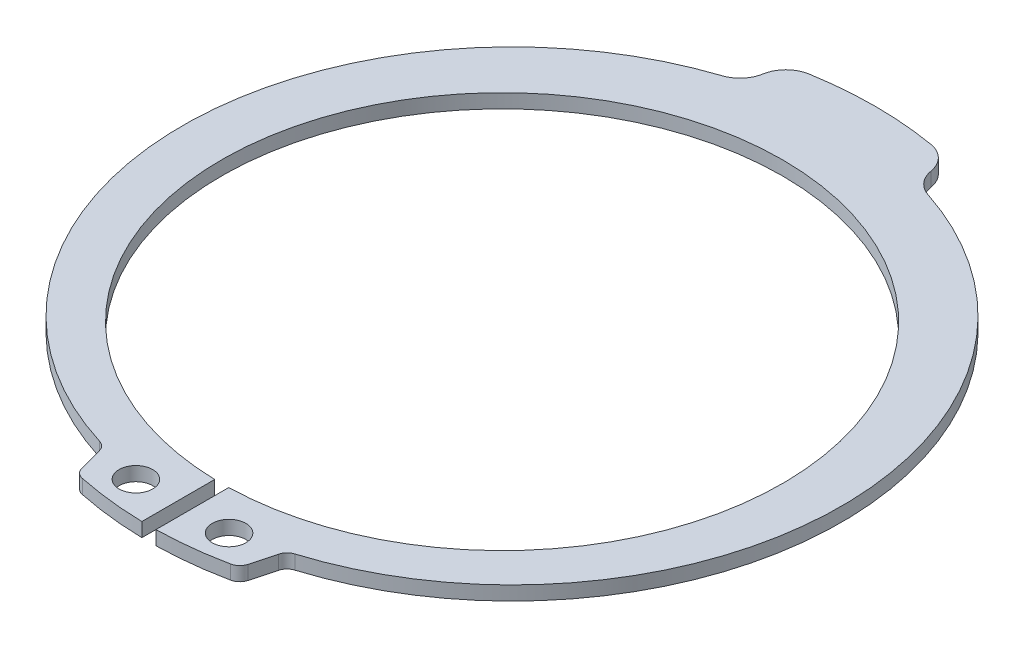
ISO-10303-21;
HEADER;
FILE_DESCRIPTION(('STEP AP214'),'2;1');
FILE_NAME('part.step','',(''),(''),'','','');
FILE_SCHEMA(('AUTOMOTIVE_DESIGN { 1 0 10303 214 1 1 1 1 }'));
ENDSEC;
DATA;
#1=APPLICATION_CONTEXT('core data for automotive mechanical design processes');
#2=APPLICATION_PROTOCOL_DEFINITION('international standard','automotive_design',2000,#1);
#3=PRODUCT_CONTEXT('',#1,'mechanical');
#4=PRODUCT('Part','Part','',(#3));
#5=PRODUCT_RELATED_PRODUCT_CATEGORY('part','',(#4));
#6=PRODUCT_DEFINITION_FORMATION('','',#4);
#7=PRODUCT_DEFINITION_CONTEXT('part definition',#1,'design');
#8=PRODUCT_DEFINITION('design','',#6,#7);
#9=PRODUCT_DEFINITION_SHAPE('','',#8);
#10=(LENGTH_UNIT() NAMED_UNIT(*) SI_UNIT(.MILLI.,.METRE.));
#11=(NAMED_UNIT(*) PLANE_ANGLE_UNIT() SI_UNIT($,.RADIAN.));
#12=(NAMED_UNIT(*) SI_UNIT($,.STERADIAN.) SOLID_ANGLE_UNIT());
#13=UNCERTAINTY_MEASURE_WITH_UNIT(LENGTH_MEASURE(1.E-05),#10,'distance_accuracy_value','');
#14=(GEOMETRIC_REPRESENTATION_CONTEXT(3) GLOBAL_UNCERTAINTY_ASSIGNED_CONTEXT((#13)) GLOBAL_UNIT_ASSIGNED_CONTEXT((#10,
#11,#12)) REPRESENTATION_CONTEXT('',''));
#15=CARTESIAN_POINT('',(0.,0.,0.));
#16=DIRECTION('',(0.,0.,1.));
#17=DIRECTION('',(1.,0.,0.));
#18=AXIS2_PLACEMENT_3D('',#15,#16,#17);
#19=CARTESIAN_POINT('',(-12.22012659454,0.5,13.46540182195));
#20=DIRECTION('',(0.,1.,0.));
#21=DIRECTION('',(1.,0.,0.));
#22=AXIS2_PLACEMENT_3D('',#19,#20,#21);
#23=PLANE('',#22);
#24=CARTESIAN_POINT('',(-1.661154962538,0.5,11.75));
#25=DIRECTION('',(0.,1.,0.));
#26=DIRECTION('',(0.,0.,1.));
#27=AXIS2_PLACEMENT_3D('',#24,#25,#26);
#28=CIRCLE('',#27,0.6);
#29=CARTESIAN_POINT('',(-1.661154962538,0.5,12.35));
#30=VERTEX_POINT('',#29);
#31=EDGE_CURVE('E157',#30,#30,#28,.F.);
#32=ORIENTED_EDGE('',*,*,#31,.T.);
#33=EDGE_LOOP('',(#32));
#34=FACE_BOUND('',#33,.T.);
#35=CARTESIAN_POINT('',(1.661154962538,0.5,11.75));
#36=DIRECTION('',(0.,1.,0.));
#37=DIRECTION('',(0.,0.,1.));
#38=AXIS2_PLACEMENT_3D('',#35,#36,#37);
#39=CIRCLE('',#38,0.6);
#40=CARTESIAN_POINT('',(1.661154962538,0.5,12.35));
#41=VERTEX_POINT('',#40);
#42=EDGE_CURVE('E154',#41,#41,#39,.F.);
#43=ORIENTED_EDGE('',*,*,#42,.T.);
#44=EDGE_LOOP('',(#43));
#45=FACE_BOUND('',#44,.T.);
#46=CARTESIAN_POINT('',(0.,0.5,0.));
#47=DIRECTION('',(0.,1.,0.));
#48=DIRECTION('',(0.,0.,1.));
#49=AXIS2_PLACEMENT_3D('',#46,#47,#48);
#50=CIRCLE('',#49,11.75);
#51=CARTESIAN_POINT('',(-3.67039396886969,0.5,-11.1620207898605));
#52=VERTEX_POINT('',#51);
#53=CARTESIAN_POINT('',(-3.47761216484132,0.5,11.2235784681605));
#54=VERTEX_POINT('',#53);
#55=EDGE_CURVE('E195',#52,#54,#50,.T.);
#56=ORIENTED_EDGE('',*,*,#55,.T.);
#57=CARTESIAN_POINT('',(-3.601918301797,0.5,11.62476169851));
#58=DIRECTION('',(0.,1.,0.));
#59=DIRECTION('',(0.,0.,1.));
#60=AXIS2_PLACEMENT_3D('',#57,#58,#59);
#61=CIRCLE('',#60,0.419999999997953);
#62=CARTESIAN_POINT('',(-3.19626236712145,0.5,11.5159349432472));
#63=VERTEX_POINT('',#62);
#64=EDGE_CURVE('E191',#54,#63,#61,.F.);
#65=ORIENTED_EDGE('',*,*,#64,.T.);
#66=DIRECTION('',(-0.259111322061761,0.,-0.965847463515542));
#67=VECTOR('',#66,1.);
#68=CARTESIAN_POINT('',(-3.081137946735,0.5,11.945065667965));
#69=LINE('',#68,#67);
#70=CARTESIAN_POINT('',(-2.96601352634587,0.5,12.3741963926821));
#71=VERTEX_POINT('',#70);
#72=EDGE_CURVE('E210',#63,#71,#69,.F.);
#73=ORIENTED_EDGE('',*,*,#72,.T.);
#74=CARTESIAN_POINT('',(-2.560357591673,0.5,12.26536963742));
#75=DIRECTION('',(0.,-1.,0.));
#76=DIRECTION('',(0.,0.,-1.));
#77=AXIS2_PLACEMENT_3D('',#74,#75,#76);
#78=CIRCLE('',#77,0.419999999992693);
#79=CARTESIAN_POINT('',(-2.64618132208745,0.5,12.6765074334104));
#80=VERTEX_POINT('',#79);
#81=EDGE_CURVE('E188',#71,#80,#78,.F.);
#82=ORIENTED_EDGE('',*,*,#81,.T.);
#83=CARTESIAN_POINT('',(0.,0.5,0.));
#84=DIRECTION('',(0.,1.,0.));
#85=DIRECTION('',(0.,0.,1.));
#86=AXIS2_PLACEMENT_3D('',#83,#84,#85);
#87=CIRCLE('',#86,12.9497535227);
#88=CARTESIAN_POINT('',(-0.2499999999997,0.5,12.9473401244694));
#89=VERTEX_POINT('',#88);
#90=EDGE_CURVE('E184',#80,#89,#87,.T.);
#91=ORIENTED_EDGE('',*,*,#90,.T.);
#92=DIRECTION('',(0.,0.,1.));
#93=VECTOR('',#92,1.);
#94=CARTESIAN_POINT('',(-0.2499999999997,0.5,11.64930795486));
#95=LINE('',#94,#93);
#96=CARTESIAN_POINT('',(-0.249999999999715,0.5,10.3512757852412));
#97=VERTEX_POINT('',#96);
#98=EDGE_CURVE('E208',#89,#97,#95,.F.);
#99=ORIENTED_EDGE('',*,*,#98,.T.);
#100=CARTESIAN_POINT('',(0.,0.5,0.3544012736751));
#101=DIRECTION('',(0.,1.,0.));
#102=DIRECTION('',(0.,0.,1.));
#103=AXIS2_PLACEMENT_3D('',#100,#101,#102);
#104=CIRCLE('',#103,10.);
#105=CARTESIAN_POINT('',(0.2499999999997,0.5,10.3512757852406));
#106=VERTEX_POINT('',#105);
#107=EDGE_CURVE('E180',#97,#106,#104,.F.);
#108=ORIENTED_EDGE('',*,*,#107,.T.);
#109=DIRECTION('',(0.,0.,-1.));
#110=VECTOR('',#109,1.);
#111=CARTESIAN_POINT('',(0.2499999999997,0.5,11.64930795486));
#112=LINE('',#111,#110);
#113=CARTESIAN_POINT('',(0.249999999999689,0.5,12.9473401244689));
#114=VERTEX_POINT('',#113);
#115=EDGE_CURVE('E206',#106,#114,#112,.F.);
#116=ORIENTED_EDGE('',*,*,#115,.T.);
#117=CARTESIAN_POINT('',(0.,0.5,0.));
#118=DIRECTION('',(0.,1.,0.));
#119=DIRECTION('',(0.,0.,1.));
#120=AXIS2_PLACEMENT_3D('',#117,#118,#119);
#121=CIRCLE('',#120,12.9497535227);
#122=CARTESIAN_POINT('',(2.64618132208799,0.5,12.676507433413));
#123=VERTEX_POINT('',#122);
#124=EDGE_CURVE('E177',#114,#123,#121,.T.);
#125=ORIENTED_EDGE('',*,*,#124,.T.);
#126=CARTESIAN_POINT('',(2.560357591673,0.5,12.26536963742));
#127=DIRECTION('',(0.,-1.,0.));
#128=DIRECTION('',(0.,0.,-1.));
#129=AXIS2_PLACEMENT_3D('',#126,#127,#128);
#130=CIRCLE('',#129,0.419999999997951);
#131=CARTESIAN_POINT('',(2.96601352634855,0.5,12.3741963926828));
#132=VERTEX_POINT('',#131);
#133=EDGE_CURVE('E173',#123,#132,#130,.F.);
#134=ORIENTED_EDGE('',*,*,#133,.T.);
#135=DIRECTION('',(-0.259111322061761,0.,0.965847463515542));
#136=VECTOR('',#135,1.);
#137=CARTESIAN_POINT('',(3.081137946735,0.5,11.945065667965));
#138=LINE('',#137,#136);
#139=CARTESIAN_POINT('',(3.19626236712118,0.5,11.5159349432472));
#140=VERTEX_POINT('',#139);
#141=EDGE_CURVE('E204',#132,#140,#138,.F.);
#142=ORIENTED_EDGE('',*,*,#141,.T.);
#143=CARTESIAN_POINT('',(3.601918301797,0.5,11.62476169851));
#144=DIRECTION('',(0.,1.,0.));
#145=DIRECTION('',(0.,0.,1.));
#146=AXIS2_PLACEMENT_3D('',#143,#144,#145);
#147=CIRCLE('',#146,0.419999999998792);
#148=CARTESIAN_POINT('',(3.47761216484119,0.5,11.2235784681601));
#149=VERTEX_POINT('',#148);
#150=EDGE_CURVE('E170',#140,#149,#147,.F.);
#151=ORIENTED_EDGE('',*,*,#150,.T.);
#152=CARTESIAN_POINT('',(0.,0.5,0.));
#153=DIRECTION('',(0.,1.,0.));
#154=DIRECTION('',(0.,0.,1.));
#155=AXIS2_PLACEMENT_3D('',#152,#153,#154);
#156=CIRCLE('',#155,11.75);
#157=CARTESIAN_POINT('',(3.67039396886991,0.5,-11.1620207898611));
#158=VERTEX_POINT('',#157);
#159=EDGE_CURVE('E167',#149,#158,#156,.T.);
#160=ORIENTED_EDGE('',*,*,#159,.T.);
#161=CARTESIAN_POINT('',(3.982767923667,0.5,-12.11198000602));
#162=DIRECTION('',(0.,1.,0.));
#163=DIRECTION('',(0.,0.,1.));
#164=AXIS2_PLACEMENT_3D('',#161,#162,#163);
#165=CIRCLE('',#164,1.);
#166=CARTESIAN_POINT('',(2.99669185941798,0.5,-11.9456851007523));
#167=VERTEX_POINT('',#166);
#168=EDGE_CURVE('E164',#158,#167,#165,.F.);
#169=ORIENTED_EDGE('',*,*,#168,.T.);
#170=CARTESIAN_POINT('',(2.010615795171,0.5,-11.77939019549));
#171=DIRECTION('',(0.,-1.,0.));
#172=DIRECTION('',(0.,0.,-1.));
#173=AXIS2_PLACEMENT_3D('',#170,#171,#172);
#174=CIRCLE('',#173,0.999999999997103);
#175=CARTESIAN_POINT('',(2.17887163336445,0.5,-12.7651335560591));
#176=VERTEX_POINT('',#175);
#177=EDGE_CURVE('E151',#167,#176,#174,.F.);
#178=ORIENTED_EDGE('',*,*,#177,.T.);
#179=CARTESIAN_POINT('',(0.,0.5,0.));
#180=DIRECTION('',(0.,1.,0.));
#181=DIRECTION('',(0.,0.,1.));
#182=AXIS2_PLACEMENT_3D('',#179,#180,#181);
#183=CIRCLE('',#182,12.9497535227);
#184=CARTESIAN_POINT('',(-2.17887163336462,0.5,-12.7651335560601));
#185=VERTEX_POINT('',#184);
#186=EDGE_CURVE('E149',#176,#185,#183,.T.);
#187=ORIENTED_EDGE('',*,*,#186,.T.);
#188=CARTESIAN_POINT('',(-2.010615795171,0.5,-11.77939019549));
#189=DIRECTION('',(0.,-1.,0.));
#190=DIRECTION('',(0.,0.,-1.));
#191=AXIS2_PLACEMENT_3D('',#188,#189,#190);
#192=CIRCLE('',#191,0.99999999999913);
#193=CARTESIAN_POINT('',(-2.99669185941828,0.5,-11.9456851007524));
#194=VERTEX_POINT('',#193);
#195=EDGE_CURVE('E19',#185,#194,#192,.F.);
#196=ORIENTED_EDGE('',*,*,#195,.T.);
#197=CARTESIAN_POINT('',(-3.982767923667,0.5,-12.11198000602));
#198=DIRECTION('',(0.,1.,0.));
#199=DIRECTION('',(0.,0.,1.));
#200=AXIS2_PLACEMENT_3D('',#197,#198,#199);
#201=CIRCLE('',#200,1.00000000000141);
#202=EDGE_CURVE('E197',#194,#52,#201,.F.);
#203=ORIENTED_EDGE('',*,*,#202,.T.);
#204=EDGE_LOOP('',(#56,#65,#73,#82,#91,#99,#108,#116,#125,#134,#142,#151,#160,#169,#178,#187,
#196,#203));
#205=FACE_BOUND('',#204,.T.);
#206=ADVANCED_FACE('F15',(#34,#45,#205),#23,.T.);
#207=CARTESIAN_POINT('',(-2.010615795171,0.5,-11.77939019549));
#208=DIRECTION('',(0.,-1.,0.));
#209=DIRECTION('',(0.,0.,-1.));
#210=AXIS2_PLACEMENT_3D('',#207,#208,#209);
#211=CYLINDRICAL_SURFACE('',#210,0.99999999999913);
#212=ORIENTED_EDGE('',*,*,#195,.F.);
#213=DIRECTION('',(0.,-1.,0.));
#214=VECTOR('',#213,1.);
#215=CARTESIAN_POINT('',(-2.17887163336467,0.25000000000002,-12.7651335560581));
#216=LINE('',#215,#214);
#217=CARTESIAN_POINT('',(-2.17887163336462,0.,-12.7651335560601));
#218=VERTEX_POINT('',#217);
#219=EDGE_CURVE('E143',#185,#218,#216,.T.);
#220=ORIENTED_EDGE('',*,*,#219,.T.);
#221=CARTESIAN_POINT('',(-2.010615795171,0.,-11.77939019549));
#222=DIRECTION('',(0.,-1.,0.));
#223=DIRECTION('',(0.,0.,-1.));
#224=AXIS2_PLACEMENT_3D('',#221,#222,#223);
#225=CIRCLE('',#224,0.99999999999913);
#226=CARTESIAN_POINT('',(-2.99669185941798,0.,-11.9456851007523));
#227=VERTEX_POINT('',#226);
#228=EDGE_CURVE('E259',#218,#227,#225,.F.);
#229=ORIENTED_EDGE('',*,*,#228,.T.);
#230=DIRECTION('',(0.,-1.,0.));
#231=VECTOR('',#230,1.);
#232=CARTESIAN_POINT('',(-2.99669185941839,0.25000000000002,-11.9456851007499));
#233=LINE('',#232,#231);
#234=EDGE_CURVE('E144',#227,#194,#233,.F.);
#235=ORIENTED_EDGE('',*,*,#234,.T.);
#236=EDGE_LOOP('',(#212,#220,#229,#235));
#237=FACE_BOUND('',#236,.T.);
#238=ADVANCED_FACE('F141',(#237),#211,.T.);
#239=CARTESIAN_POINT('',(-3.982767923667,0.,-12.11198000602));
#240=DIRECTION('',(0.,1.,0.));
#241=DIRECTION('',(0.,0.,1.));
#242=AXIS2_PLACEMENT_3D('',#239,#240,#241);
#243=CYLINDRICAL_SURFACE('',#242,1.00000000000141);
#244=DIRECTION('',(0.,1.,0.));
#245=VECTOR('',#244,1.);
#246=CARTESIAN_POINT('',(-3.67039396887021,0.25000000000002,-11.1620207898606));
#247=LINE('',#246,#245);
#248=CARTESIAN_POINT('',(-3.67039396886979,0.,-11.1620207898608));
#249=VERTEX_POINT('',#248);
#250=EDGE_CURVE('E196',#249,#52,#247,.T.);
#251=ORIENTED_EDGE('',*,*,#250,.T.);
#252=ORIENTED_EDGE('',*,*,#202,.F.);
#253=ORIENTED_EDGE('',*,*,#234,.F.);
#254=CARTESIAN_POINT('',(-3.982767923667,0.,-12.11198000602));
#255=DIRECTION('',(0.,1.,0.));
#256=DIRECTION('',(0.,0.,1.));
#257=AXIS2_PLACEMENT_3D('',#254,#255,#256);
#258=CIRCLE('',#257,1.00000000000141);
#259=EDGE_CURVE('E256',#227,#249,#258,.F.);
#260=ORIENTED_EDGE('',*,*,#259,.T.);
#261=EDGE_LOOP('',(#251,#252,#253,#260));
#262=FACE_BOUND('',#261,.T.);
#263=ADVANCED_FACE('F395',(#262),#243,.F.);
#264=CARTESIAN_POINT('',(0.,0.,0.));
#265=DIRECTION('',(0.,1.,0.));
#266=DIRECTION('',(0.,0.,1.));
#267=AXIS2_PLACEMENT_3D('',#264,#265,#266);
#268=CYLINDRICAL_SURFACE('',#267,11.75);
#269=DIRECTION('',(0.,-1.,0.));
#270=VECTOR('',#269,1.);
#271=CARTESIAN_POINT('',(-3.47761216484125,0.25000000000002,11.2235784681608));
#272=LINE('',#271,#270);
#273=CARTESIAN_POINT('',(-3.47761216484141,0.,11.2235784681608));
#274=VERTEX_POINT('',#273);
#275=EDGE_CURVE('E194',#274,#54,#272,.F.);
#276=ORIENTED_EDGE('',*,*,#275,.T.);
#277=ORIENTED_EDGE('',*,*,#55,.F.);
#278=ORIENTED_EDGE('',*,*,#250,.F.);
#279=CARTESIAN_POINT('',(0.,0.,0.));
#280=DIRECTION('',(0.,1.,0.));
#281=DIRECTION('',(0.,0.,1.));
#282=AXIS2_PLACEMENT_3D('',#279,#280,#281);
#283=CIRCLE('',#282,11.75);
#284=EDGE_CURVE('E253',#249,#274,#283,.T.);
#285=ORIENTED_EDGE('',*,*,#284,.T.);
#286=EDGE_LOOP('',(#276,#277,#278,#285));
#287=FACE_BOUND('',#286,.T.);
#288=ADVANCED_FACE('F313',(#287),#268,.T.);
#289=CARTESIAN_POINT('',(-3.601918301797,0.,11.62476169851));
#290=DIRECTION('',(0.,1.,0.));
#291=DIRECTION('',(0.,0.,1.));
#292=AXIS2_PLACEMENT_3D('',#289,#290,#291);
#293=CYLINDRICAL_SURFACE('',#292,0.419999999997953);
#294=ORIENTED_EDGE('',*,*,#275,.F.);
#295=CARTESIAN_POINT('',(-3.601918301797,0.,11.62476169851));
#296=DIRECTION('',(0.,1.,0.));
#297=DIRECTION('',(0.,0.,1.));
#298=AXIS2_PLACEMENT_3D('',#295,#296,#297);
#299=CIRCLE('',#298,0.419999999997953);
#300=CARTESIAN_POINT('',(-3.19626236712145,0.,11.5159349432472));
#301=VERTEX_POINT('',#300);
#302=EDGE_CURVE('E250',#274,#301,#299,.F.);
#303=ORIENTED_EDGE('',*,*,#302,.T.);
#304=DIRECTION('',(0.,-1.,0.));
#305=VECTOR('',#304,1.);
#306=CARTESIAN_POINT('',(-3.19626236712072,0.25000000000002,11.5159349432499));
#307=LINE('',#306,#305);
#308=EDGE_CURVE('E193',#301,#63,#307,.F.);
#309=ORIENTED_EDGE('',*,*,#308,.T.);
#310=ORIENTED_EDGE('',*,*,#64,.F.);
#311=EDGE_LOOP('',(#294,#303,#309,#310));
#312=FACE_BOUND('',#311,.T.);
#313=ADVANCED_FACE('F318',(#312),#293,.F.);
#314=CARTESIAN_POINT('',(-3.207139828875,-0.04197987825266,11.47538878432));
#315=DIRECTION('',(-0.965847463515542,0.,0.259111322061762));
#316=DIRECTION('',(0.259111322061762,0.,0.965847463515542));
#317=AXIS2_PLACEMENT_3D('',#314,#315,#316);
#318=PLANE('',#317);
#319=ORIENTED_EDGE('',*,*,#308,.F.);
#320=DIRECTION('',(0.259111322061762,0.,0.965847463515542));
#321=VECTOR('',#320,1.);
#322=CARTESIAN_POINT('',(-3.207139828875,0.,11.47538878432));
#323=LINE('',#322,#321);
#324=CARTESIAN_POINT('',(-2.96601352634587,0.,12.3741963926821));
#325=VERTEX_POINT('',#324);
#326=EDGE_CURVE('E247',#301,#325,#323,.T.);
#327=ORIENTED_EDGE('',*,*,#326,.T.);
#328=DIRECTION('',(0.,1.,0.));
#329=VECTOR('',#328,1.);
#330=CARTESIAN_POINT('',(-2.96601352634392,0.25000000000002,12.3741963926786));
#331=LINE('',#330,#329);
#332=EDGE_CURVE('E190',#325,#71,#331,.T.);
#333=ORIENTED_EDGE('',*,*,#332,.T.);
#334=ORIENTED_EDGE('',*,*,#72,.F.);
#335=EDGE_LOOP('',(#319,#327,#333,#334));
#336=FACE_BOUND('',#335,.T.);
#337=ADVANCED_FACE('F324',(#336),#318,.T.);
#338=CARTESIAN_POINT('',(-2.560357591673,0.5,12.26536963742));
#339=DIRECTION('',(0.,-1.,0.));
#340=DIRECTION('',(0.,0.,-1.));
#341=AXIS2_PLACEMENT_3D('',#338,#339,#340);
#342=CYLINDRICAL_SURFACE('',#341,0.419999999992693);
#343=ORIENTED_EDGE('',*,*,#81,.F.);
#344=ORIENTED_EDGE('',*,*,#332,.F.);
#345=CARTESIAN_POINT('',(-2.560357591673,0.,12.26536963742));
#346=DIRECTION('',(0.,-1.,0.));
#347=DIRECTION('',(0.,0.,-1.));
#348=AXIS2_PLACEMENT_3D('',#345,#346,#347);
#349=CIRCLE('',#348,0.419999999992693);
#350=CARTESIAN_POINT('',(-2.64618132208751,0.,12.6765074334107));
#351=VERTEX_POINT('',#350);
#352=EDGE_CURVE('E244',#325,#351,#349,.F.);
#353=ORIENTED_EDGE('',*,*,#352,.T.);
#354=DIRECTION('',(0.,1.,0.));
#355=VECTOR('',#354,1.);
#356=CARTESIAN_POINT('',(-2.64618132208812,0.25000000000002,12.6765074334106));
#357=LINE('',#356,#355);
#358=EDGE_CURVE('E187',#351,#80,#357,.T.);
#359=ORIENTED_EDGE('',*,*,#358,.T.);
#360=EDGE_LOOP('',(#343,#344,#353,#359));
#361=FACE_BOUND('',#360,.T.);
#362=ADVANCED_FACE('F329',(#361),#342,.T.);
#363=CARTESIAN_POINT('',(0.,0.,0.));
#364=DIRECTION('',(0.,1.,0.));
#365=DIRECTION('',(0.,0.,1.));
#366=AXIS2_PLACEMENT_3D('',#363,#364,#365);
#367=CYLINDRICAL_SURFACE('',#366,12.9497535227);
#368=DIRECTION('',(0.,-1.,0.));
#369=VECTOR('',#368,1.);
#370=CARTESIAN_POINT('',(-0.2499999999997,0.25000000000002,12.94734012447));
#371=LINE('',#370,#369);
#372=CARTESIAN_POINT('',(-0.2499999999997,0.,12.9473401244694));
#373=VERTEX_POINT('',#372);
#374=EDGE_CURVE('E186',#373,#89,#371,.F.);
#375=ORIENTED_EDGE('',*,*,#374,.T.);
#376=ORIENTED_EDGE('',*,*,#90,.F.);
#377=ORIENTED_EDGE('',*,*,#358,.F.);
#378=CARTESIAN_POINT('',(0.,0.,0.));
#379=DIRECTION('',(0.,1.,0.));
#380=DIRECTION('',(0.,0.,1.));
#381=AXIS2_PLACEMENT_3D('',#378,#379,#380);
#382=CIRCLE('',#381,12.9497535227);
#383=EDGE_CURVE('E241',#351,#373,#382,.T.);
#384=ORIENTED_EDGE('',*,*,#383,.T.);
#385=EDGE_LOOP('',(#375,#376,#377,#384));
#386=FACE_BOUND('',#385,.T.);
#387=ADVANCED_FACE('F331',(#386),#367,.T.);
#388=CARTESIAN_POINT('',(-0.2499999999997,-0.04197987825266,12.99926141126));
#389=DIRECTION('',(1.,0.,0.));
#390=DIRECTION('',(0.,0.,-1.));
#391=AXIS2_PLACEMENT_3D('',#388,#389,#390);
#392=PLANE('',#391);
#393=ORIENTED_EDGE('',*,*,#98,.F.);
#394=ORIENTED_EDGE('',*,*,#374,.F.);
#395=DIRECTION('',(0.,0.,-1.));
#396=VECTOR('',#395,1.);
#397=CARTESIAN_POINT('',(-0.2499999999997,0.,-0.00420231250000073));
#398=LINE('',#397,#396);
#399=CARTESIAN_POINT('',(-0.249999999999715,0.,10.3512757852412));
#400=VERTEX_POINT('',#399);
#401=EDGE_CURVE('E240',#373,#400,#398,.T.);
#402=ORIENTED_EDGE('',*,*,#401,.T.);
#403=DIRECTION('',(0.,-1.,0.));
#404=VECTOR('',#403,1.);
#405=CARTESIAN_POINT('',(-0.24999999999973,0.25000000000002,10.3512757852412));
#406=LINE('',#405,#404);
#407=EDGE_CURVE('E183',#400,#97,#406,.F.);
#408=ORIENTED_EDGE('',*,*,#407,.T.);
#409=EDGE_LOOP('',(#393,#394,#402,#408));
#410=FACE_BOUND('',#409,.T.);
#411=ADVANCED_FACE('F349',(#410),#392,.T.);
#412=CARTESIAN_POINT('',(0.,0.,0.3544012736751));
#413=DIRECTION('',(0.,1.,0.));
#414=DIRECTION('',(0.,0.,1.));
#415=AXIS2_PLACEMENT_3D('',#412,#413,#414);
#416=CYLINDRICAL_SURFACE('',#415,10.);
#417=ORIENTED_EDGE('',*,*,#107,.F.);
#418=ORIENTED_EDGE('',*,*,#407,.F.);
#419=CARTESIAN_POINT('',(0.,0.,0.3544012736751));
#420=DIRECTION('',(0.,1.,0.));
#421=DIRECTION('',(0.,0.,1.));
#422=AXIS2_PLACEMENT_3D('',#419,#420,#421);
#423=CIRCLE('',#422,10.);
#424=CARTESIAN_POINT('',(0.2499999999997,0.,10.3512757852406));
#425=VERTEX_POINT('',#424);
#426=EDGE_CURVE('E237',#400,#425,#423,.F.);
#427=ORIENTED_EDGE('',*,*,#426,.T.);
#428=DIRECTION('',(0.,-1.,0.));
#429=VECTOR('',#428,1.);
#430=CARTESIAN_POINT('',(0.2499999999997,0.25000000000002,10.35127578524));
#431=LINE('',#430,#429);
#432=EDGE_CURVE('E182',#425,#106,#431,.F.);
#433=ORIENTED_EDGE('',*,*,#432,.T.);
#434=EDGE_LOOP('',(#417,#418,#427,#433));
#435=FACE_BOUND('',#434,.T.);
#436=ADVANCED_FACE('F347',(#435),#416,.F.);
#437=CARTESIAN_POINT('',(0.2499999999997,-0.04197987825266,10.29935449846));
#438=DIRECTION('',(-1.,0.,0.));
#439=DIRECTION('',(0.,0.,1.));
#440=AXIS2_PLACEMENT_3D('',#437,#438,#439);
#441=PLANE('',#440);
#442=ORIENTED_EDGE('',*,*,#115,.F.);
#443=ORIENTED_EDGE('',*,*,#432,.F.);
#444=DIRECTION('',(0.,0.,1.));
#445=VECTOR('',#444,1.);
#446=CARTESIAN_POINT('',(0.2499999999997,0.,-0.00420231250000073));
#447=LINE('',#446,#445);
#448=CARTESIAN_POINT('',(0.249999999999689,0.,12.9473401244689));
#449=VERTEX_POINT('',#448);
#450=EDGE_CURVE('E236',#425,#449,#447,.T.);
#451=ORIENTED_EDGE('',*,*,#450,.T.);
#452=DIRECTION('',(0.,1.,0.));
#453=VECTOR('',#452,1.);
#454=CARTESIAN_POINT('',(0.249999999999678,0.25000000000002,12.9473401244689));
#455=LINE('',#454,#453);
#456=EDGE_CURVE('E179',#449,#114,#455,.T.);
#457=ORIENTED_EDGE('',*,*,#456,.T.);
#458=EDGE_LOOP('',(#442,#443,#451,#457));
#459=FACE_BOUND('',#458,.T.);
#460=ADVANCED_FACE('F342',(#459),#441,.T.);
#461=CARTESIAN_POINT('',(0.,0.,0.));
#462=DIRECTION('',(0.,1.,0.));
#463=DIRECTION('',(0.,0.,1.));
#464=AXIS2_PLACEMENT_3D('',#461,#462,#463);
#465=CYLINDRICAL_SURFACE('',#464,12.9497535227);
#466=ORIENTED_EDGE('',*,*,#456,.F.);
#467=CARTESIAN_POINT('',(0.,0.,0.));
#468=DIRECTION('',(0.,1.,0.));
#469=DIRECTION('',(0.,0.,1.));
#470=AXIS2_PLACEMENT_3D('',#467,#468,#469);
#471=CIRCLE('',#470,12.9497535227);
#472=CARTESIAN_POINT('',(2.64618132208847,0.,12.6765074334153));
#473=VERTEX_POINT('',#472);
#474=EDGE_CURVE('E233',#449,#473,#471,.T.);
#475=ORIENTED_EDGE('',*,*,#474,.T.);
#476=DIRECTION('',(0.,1.,0.));
#477=VECTOR('',#476,1.);
#478=CARTESIAN_POINT('',(2.64618132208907,0.25000000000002,12.6765074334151));
#479=LINE('',#478,#477);
#480=EDGE_CURVE('E176',#473,#123,#479,.T.);
#481=ORIENTED_EDGE('',*,*,#480,.T.);
#482=ORIENTED_EDGE('',*,*,#124,.F.);
#483=EDGE_LOOP('',(#466,#475,#481,#482));
#484=FACE_BOUND('',#483,.T.);
#485=ADVANCED_FACE('F353',(#484),#465,.T.);
#486=CARTESIAN_POINT('',(2.560357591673,0.5,12.26536963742));
#487=DIRECTION('',(0.,-1.,0.));
#488=DIRECTION('',(0.,0.,-1.));
#489=AXIS2_PLACEMENT_3D('',#486,#487,#488);
#490=CYLINDRICAL_SURFACE('',#489,0.419999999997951);
#491=ORIENTED_EDGE('',*,*,#133,.F.);
#492=ORIENTED_EDGE('',*,*,#480,.F.);
#493=CARTESIAN_POINT('',(2.560357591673,0.,12.26536963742));
#494=DIRECTION('',(0.,-1.,0.));
#495=DIRECTION('',(0.,0.,-1.));
#496=AXIS2_PLACEMENT_3D('',#493,#494,#495);
#497=CIRCLE('',#496,0.419999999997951);
#498=CARTESIAN_POINT('',(2.96601352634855,0.,12.3741963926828));
#499=VERTEX_POINT('',#498);
#500=EDGE_CURVE('E230',#473,#499,#497,.F.);
#501=ORIENTED_EDGE('',*,*,#500,.T.);
#502=DIRECTION('',(0.,-1.,0.));
#503=VECTOR('',#502,1.);
#504=CARTESIAN_POINT('',(2.96601352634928,0.25000000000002,12.3741963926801));
#505=LINE('',#504,#503);
#506=EDGE_CURVE('E175',#499,#132,#505,.F.);
#507=ORIENTED_EDGE('',*,*,#506,.T.);
#508=EDGE_LOOP('',(#491,#492,#501,#507));
#509=FACE_BOUND('',#508,.T.);
#510=ADVANCED_FACE('F355',(#509),#490,.T.);
#511=CARTESIAN_POINT('',(2.955136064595,-0.04197987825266,12.41474255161));
#512=DIRECTION('',(0.965847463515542,0.,0.259111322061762));
#513=DIRECTION('',(0.259111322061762,0.,-0.965847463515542));
#514=AXIS2_PLACEMENT_3D('',#511,#512,#513);
#515=PLANE('',#514);
#516=DIRECTION('',(0.,-1.,0.));
#517=VECTOR('',#516,1.);
#518=CARTESIAN_POINT('',(3.19626236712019,0.25000000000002,11.5159349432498));
#519=LINE('',#518,#517);
#520=CARTESIAN_POINT('',(3.19626236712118,0.,11.5159349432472));
#521=VERTEX_POINT('',#520);
#522=EDGE_CURVE('E172',#521,#140,#519,.F.);
#523=ORIENTED_EDGE('',*,*,#522,.T.);
#524=ORIENTED_EDGE('',*,*,#141,.F.);
#525=ORIENTED_EDGE('',*,*,#506,.F.);
#526=DIRECTION('',(0.259111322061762,0.,-0.965847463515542));
#527=VECTOR('',#526,1.);
#528=CARTESIAN_POINT('',(2.955136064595,0.,12.41474255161));
#529=LINE('',#528,#527);
#530=EDGE_CURVE('E227',#499,#521,#529,.T.);
#531=ORIENTED_EDGE('',*,*,#530,.T.);
#532=EDGE_LOOP('',(#523,#524,#525,#531));
#533=FACE_BOUND('',#532,.T.);
#534=ADVANCED_FACE('F359',(#533),#515,.T.);
#535=CARTESIAN_POINT('',(3.601918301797,0.,11.62476169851));
#536=DIRECTION('',(0.,1.,0.));
#537=DIRECTION('',(0.,0.,1.));
#538=AXIS2_PLACEMENT_3D('',#535,#536,#537);
#539=CYLINDRICAL_SURFACE('',#538,0.419999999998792);
#540=ORIENTED_EDGE('',*,*,#522,.F.);
#541=CARTESIAN_POINT('',(3.601918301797,0.,11.62476169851));
#542=DIRECTION('',(0.,1.,0.));
#543=DIRECTION('',(0.,0.,1.));
#544=AXIS2_PLACEMENT_3D('',#541,#542,#543);
#545=CIRCLE('',#544,0.419999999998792);
#546=CARTESIAN_POINT('',(3.47761216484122,0.,11.2235784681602));
#547=VERTEX_POINT('',#546);
#548=EDGE_CURVE('E224',#521,#547,#545,.F.);
#549=ORIENTED_EDGE('',*,*,#548,.T.);
#550=DIRECTION('',(0.,1.,0.));
#551=VECTOR('',#550,1.);
#552=CARTESIAN_POINT('',(3.47761216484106,0.25000000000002,11.2235784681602));
#553=LINE('',#552,#551);
#554=EDGE_CURVE('E169',#547,#149,#553,.T.);
#555=ORIENTED_EDGE('',*,*,#554,.T.);
#556=ORIENTED_EDGE('',*,*,#150,.F.);
#557=EDGE_LOOP('',(#540,#549,#555,#556));
#558=FACE_BOUND('',#557,.T.);
#559=ADVANCED_FACE('F363',(#558),#539,.F.);
#560=CARTESIAN_POINT('',(0.,0.,0.));
#561=DIRECTION('',(0.,1.,0.));
#562=DIRECTION('',(0.,0.,1.));
#563=AXIS2_PLACEMENT_3D('',#560,#561,#562);
#564=CYLINDRICAL_SURFACE('',#563,11.75);
#565=ORIENTED_EDGE('',*,*,#554,.F.);
#566=CARTESIAN_POINT('',(0.,0.,0.));
#567=DIRECTION('',(0.,1.,0.));
#568=DIRECTION('',(0.,0.,1.));
#569=AXIS2_PLACEMENT_3D('',#566,#567,#568);
#570=CIRCLE('',#569,11.75);
#571=CARTESIAN_POINT('',(3.67039396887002,0.,-11.1620207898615));
#572=VERTEX_POINT('',#571);
#573=EDGE_CURVE('E221',#547,#572,#570,.T.);
#574=ORIENTED_EDGE('',*,*,#573,.T.);
#575=DIRECTION('',(0.,-1.,0.));
#576=VECTOR('',#575,1.);
#577=CARTESIAN_POINT('',(3.67039396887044,0.25000000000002,-11.1620207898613));
#578=LINE('',#577,#576);
#579=EDGE_CURVE('E166',#572,#158,#578,.F.);
#580=ORIENTED_EDGE('',*,*,#579,.T.);
#581=ORIENTED_EDGE('',*,*,#159,.F.);
#582=EDGE_LOOP('',(#565,#574,#580,#581));
#583=FACE_BOUND('',#582,.T.);
#584=ADVANCED_FACE('F364',(#583),#564,.T.);
#585=CARTESIAN_POINT('',(3.982767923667,0.,-12.11198000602));
#586=DIRECTION('',(0.,1.,0.));
#587=DIRECTION('',(0.,0.,1.));
#588=AXIS2_PLACEMENT_3D('',#585,#586,#587);
#589=CYLINDRICAL_SURFACE('',#588,1.);
#590=ORIENTED_EDGE('',*,*,#579,.F.);
#591=CARTESIAN_POINT('',(3.982767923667,0.,-12.11198000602));
#592=DIRECTION('',(0.,1.,0.));
#593=DIRECTION('',(0.,0.,1.));
#594=AXIS2_PLACEMENT_3D('',#591,#592,#593);
#595=CIRCLE('',#594,1.);
#596=CARTESIAN_POINT('',(2.99669185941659,0.,-11.9456851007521));
#597=VERTEX_POINT('',#596);
#598=EDGE_CURVE('E218',#572,#597,#595,.F.);
#599=ORIENTED_EDGE('',*,*,#598,.T.);
#600=DIRECTION('',(0.,1.,0.));
#601=VECTOR('',#600,1.);
#602=CARTESIAN_POINT('',(2.996691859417,0.25000000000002,-11.9456851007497));
#603=LINE('',#602,#601);
#604=EDGE_CURVE('E163',#597,#167,#603,.T.);
#605=ORIENTED_EDGE('',*,*,#604,.T.);
#606=ORIENTED_EDGE('',*,*,#168,.F.);
#607=EDGE_LOOP('',(#590,#599,#605,#606));
#608=FACE_BOUND('',#607,.T.);
#609=ADVANCED_FACE('F282',(#608),#589,.F.);
#610=CARTESIAN_POINT('',(2.010615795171,0.5,-11.77939019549));
#611=DIRECTION('',(0.,-1.,0.));
#612=DIRECTION('',(0.,0.,-1.));
#613=AXIS2_PLACEMENT_3D('',#610,#611,#612);
#614=CYLINDRICAL_SURFACE('',#613,0.999999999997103);
#615=ORIENTED_EDGE('',*,*,#177,.F.);
#616=ORIENTED_EDGE('',*,*,#604,.F.);
#617=CARTESIAN_POINT('',(2.010615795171,0.,-11.77939019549));
#618=DIRECTION('',(0.,-1.,0.));
#619=DIRECTION('',(0.,0.,-1.));
#620=AXIS2_PLACEMENT_3D('',#617,#618,#619);
#621=CIRCLE('',#620,0.999999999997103);
#622=CARTESIAN_POINT('',(2.17887163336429,0.,-12.7651335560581));
#623=VERTEX_POINT('',#622);
#624=EDGE_CURVE('E215',#597,#623,#621,.F.);
#625=ORIENTED_EDGE('',*,*,#624,.T.);
#626=DIRECTION('',(0.,1.,0.));
#627=VECTOR('',#626,1.);
#628=CARTESIAN_POINT('',(2.17887163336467,0.25000000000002,-12.7651335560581));
#629=LINE('',#628,#627);
#630=EDGE_CURVE('E34',#623,#176,#629,.T.);
#631=ORIENTED_EDGE('',*,*,#630,.T.);
#632=EDGE_LOOP('',(#615,#616,#625,#631));
#633=FACE_BOUND('',#632,.T.);
#634=ADVANCED_FACE('F365',(#633),#614,.T.);
#635=CARTESIAN_POINT('',(0.,0.,0.));
#636=DIRECTION('',(0.,1.,0.));
#637=DIRECTION('',(0.,0.,1.));
#638=AXIS2_PLACEMENT_3D('',#635,#636,#637);
#639=CYLINDRICAL_SURFACE('',#638,12.9497535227);
#640=ORIENTED_EDGE('',*,*,#630,.F.);
#641=CARTESIAN_POINT('',(0.,0.,0.));
#642=DIRECTION('',(0.,1.,0.));
#643=DIRECTION('',(0.,0.,1.));
#644=AXIS2_PLACEMENT_3D('',#641,#642,#643);
#645=CIRCLE('',#644,12.9497535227);
#646=EDGE_CURVE('E150',#623,#218,#645,.T.);
#647=ORIENTED_EDGE('',*,*,#646,.T.);
#648=ORIENTED_EDGE('',*,*,#219,.F.);
#649=ORIENTED_EDGE('',*,*,#186,.F.);
#650=EDGE_LOOP('',(#640,#647,#648,#649));
#651=FACE_BOUND('',#650,.T.);
#652=ADVANCED_FACE('F148',(#651),#639,.T.);
#653=CARTESIAN_POINT('',(1.661154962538,0.,11.75));
#654=DIRECTION('',(0.,1.,0.));
#655=DIRECTION('',(0.,0.,1.));
#656=AXIS2_PLACEMENT_3D('',#653,#654,#655);
#657=CYLINDRICAL_SURFACE('',#656,0.6);
#658=ORIENTED_EDGE('',*,*,#42,.F.);
#659=EDGE_LOOP('',(#658));
#660=FACE_BOUND('',#659,.T.);
#661=CARTESIAN_POINT('',(1.661154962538,0.,11.75));
#662=DIRECTION('',(0.,1.,0.));
#663=DIRECTION('',(0.,0.,1.));
#664=AXIS2_PLACEMENT_3D('',#661,#662,#663);
#665=CIRCLE('',#664,0.6);
#666=CARTESIAN_POINT('',(1.661154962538,0.,12.35));
#667=VERTEX_POINT('',#666);
#668=EDGE_CURVE('E25',#667,#667,#665,.F.);
#669=ORIENTED_EDGE('',*,*,#668,.T.);
#670=EDGE_LOOP('',(#669));
#671=FACE_BOUND('',#670,.T.);
#672=ADVANCED_FACE('F268',(#660,#671),#657,.F.);
#673=CARTESIAN_POINT('',(-1.661154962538,0.,11.75));
#674=DIRECTION('',(0.,1.,0.));
#675=DIRECTION('',(0.,0.,1.));
#676=AXIS2_PLACEMENT_3D('',#673,#674,#675);
#677=CYLINDRICAL_SURFACE('',#676,0.6);
#678=ORIENTED_EDGE('',*,*,#31,.F.);
#679=EDGE_LOOP('',(#678));
#680=FACE_BOUND('',#679,.T.);
#681=CARTESIAN_POINT('',(-1.661154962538,0.,11.75));
#682=DIRECTION('',(0.,1.,0.));
#683=DIRECTION('',(0.,0.,1.));
#684=AXIS2_PLACEMENT_3D('',#681,#682,#683);
#685=CIRCLE('',#684,0.6);
#686=CARTESIAN_POINT('',(-1.661154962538,0.,12.35));
#687=VERTEX_POINT('',#686);
#688=EDGE_CURVE('E9',#687,#687,#685,.F.);
#689=ORIENTED_EDGE('',*,*,#688,.T.);
#690=EDGE_LOOP('',(#689));
#691=FACE_BOUND('',#690,.T.);
#692=ADVANCED_FACE('F265',(#680,#691),#677,.F.);
#693=CARTESIAN_POINT('',(-12.22012659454,0.,13.46540182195));
#694=DIRECTION('',(0.,1.,0.));
#695=DIRECTION('',(1.,0.,0.));
#696=AXIS2_PLACEMENT_3D('',#693,#694,#695);
#697=PLANE('',#696);
#698=ORIENTED_EDGE('',*,*,#688,.F.);
#699=EDGE_LOOP('',(#698));
#700=FACE_BOUND('',#699,.T.);
#701=ORIENTED_EDGE('',*,*,#668,.F.);
#702=EDGE_LOOP('',(#701));
#703=FACE_BOUND('',#702,.T.);
#704=ORIENTED_EDGE('',*,*,#624,.F.);
#705=ORIENTED_EDGE('',*,*,#598,.F.);
#706=ORIENTED_EDGE('',*,*,#573,.F.);
#707=ORIENTED_EDGE('',*,*,#548,.F.);
#708=ORIENTED_EDGE('',*,*,#530,.F.);
#709=ORIENTED_EDGE('',*,*,#500,.F.);
#710=ORIENTED_EDGE('',*,*,#474,.F.);
#711=ORIENTED_EDGE('',*,*,#450,.F.);
#712=ORIENTED_EDGE('',*,*,#426,.F.);
#713=ORIENTED_EDGE('',*,*,#401,.F.);
#714=ORIENTED_EDGE('',*,*,#383,.F.);
#715=ORIENTED_EDGE('',*,*,#352,.F.);
#716=ORIENTED_EDGE('',*,*,#326,.F.);
#717=ORIENTED_EDGE('',*,*,#302,.F.);
#718=ORIENTED_EDGE('',*,*,#284,.F.);
#719=ORIENTED_EDGE('',*,*,#259,.F.);
#720=ORIENTED_EDGE('',*,*,#228,.F.);
#721=ORIENTED_EDGE('',*,*,#646,.F.);
#722=EDGE_LOOP('',(#704,#705,#706,#707,#708,#709,#710,#711,#712,#713,#714,#715,#716,#717,#718,
#719,#720,#721));
#723=FACE_BOUND('',#722,.T.);
#724=ADVANCED_FACE('F17',(#700,#703,#723),#697,.F.);
#725=CLOSED_SHELL('',(#206,#238,#263,#288,#313,#337,#362,#387,#411,#436,#460,#485,#510,#534,
#559,#584,#609,#634,#652,#672,#692,#724));
#726=MANIFOLD_SOLID_BREP('B1',#725);
#727=ADVANCED_BREP_SHAPE_REPRESENTATION('',(#18,#726),#14);
#728=SHAPE_DEFINITION_REPRESENTATION(#9,#727);
ENDSEC;
END-ISO-10303-21;
